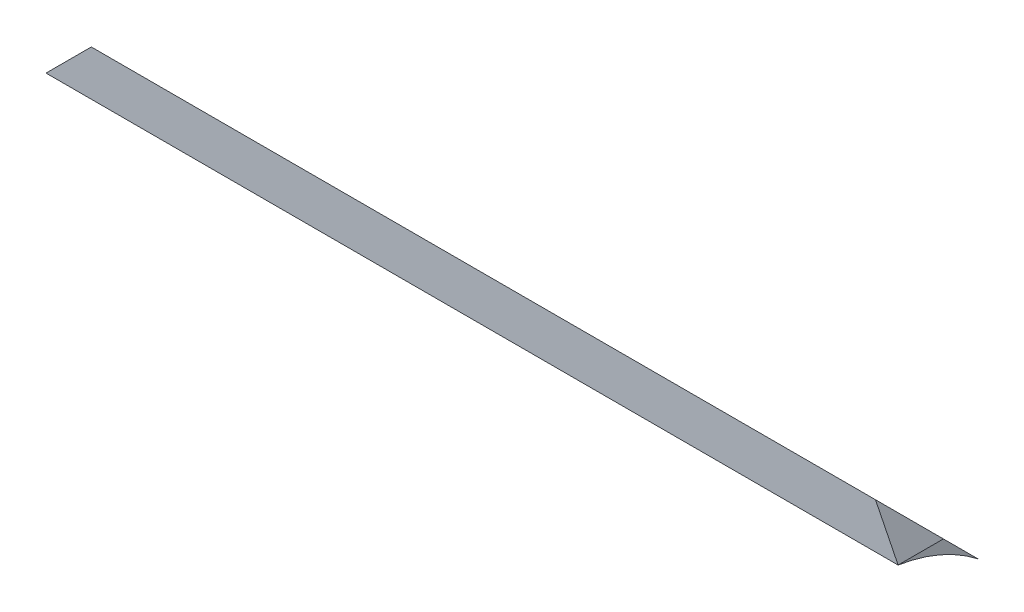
from build123d import *

# Parameters (mm, degrees)
SKETCH1_W          = 101.6
SKETCH1_H          = 12.7
EXTRUDE1_DEPTH     = 12.7
CUT_EXTRUDE1_DEPTH = 104.175287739
CUT_EXTRUDE2_DEPTH = 104.175287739
SKETCH5_OUTSIDE_W  = 124.098
SKETCH5_OUTSIDE_H  = 32.023
CUT_EXTRUDE7_DEPTH = 103.832755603


with BuildPart() as part:
    # Sketch1 → Extrude1 (new body)
    with BuildSketch(Plane(origin=(0, 0, 0), x_dir=(1, 0, 0), z_dir=(0, 1, 0))):
        with Locations((50.8, 6.35)):
            Rectangle(SKETCH1_W, SKETCH1_H)
    extrude(amount=EXTRUDE1_DEPTH)

    # Sketch2 → Cut-Extrude1 (cut, through all)
    with BuildSketch(Plane(origin=(101.6, 0, 0), x_dir=(0, 0, -1), z_dir=(1, 0, 0))):
        Polygon((0, 12.7), (12.7, 0), (12.7, 12.7), align=None)
    extrude(amount=-CUT_EXTRUDE1_DEPTH, mode=Mode.SUBTRACT)

    # Sketch3 → Cut-Extrude2 (cut, through all)
    with BuildSketch(Plane(origin=(101.6, 0, 0), x_dir=(0, 0, -1), z_dir=(1, 0, 0))):
        with BuildLine():
            Line((0, 4.370465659), (0, 22.108104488))
            Line((0, 22.108104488), (3.175, 22.108104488))
            Line((3.175, 22.108104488), (3.175, 4.124772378))
            ThreePointArc((3.175, 4.124772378), (-1.59224607, -36.843019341), (0, 4.370465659))
        make_face()
    extrude(amount=-CUT_EXTRUDE2_DEPTH, mode=Mode.SUBTRACT)

    # Sketch5 outside → Cut-Extrude7 (cut, through all)
    with BuildSketch(Plane.XY):
        with Locations((50.8, 4.7625)):
            Rectangle(SKETCH5_OUTSIDE_W, SKETCH5_OUTSIDE_H)
        Polygon((101.6, 0), (101.6, 4.124772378), (76.2, 54.924772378), (50.8, 54.924772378), (0, 4.124772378), (0, 0), align=None, mode=Mode.SUBTRACT)
    extrude(amount=-CUT_EXTRUDE7_DEPTH, mode=Mode.SUBTRACT)


solid = part.part
